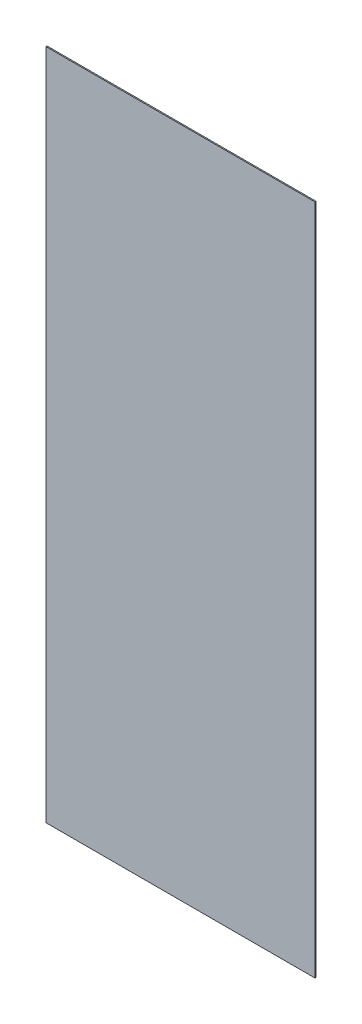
ISO-10303-21;
HEADER;
FILE_DESCRIPTION(('STEP AP214'),'2;1');
FILE_NAME('part.step','',(''),(''),'','','');
FILE_SCHEMA(('AUTOMOTIVE_DESIGN { 1 0 10303 214 1 1 1 1 }'));
ENDSEC;
DATA;
#1=APPLICATION_CONTEXT('core data for automotive mechanical design processes');
#2=APPLICATION_PROTOCOL_DEFINITION('international standard','automotive_design',2000,#1);
#3=PRODUCT_CONTEXT('',#1,'mechanical');
#4=PRODUCT('Part','Part','',(#3));
#5=PRODUCT_RELATED_PRODUCT_CATEGORY('part','',(#4));
#6=PRODUCT_DEFINITION_FORMATION('','',#4);
#7=PRODUCT_DEFINITION_CONTEXT('part definition',#1,'design');
#8=PRODUCT_DEFINITION('design','',#6,#7);
#9=PRODUCT_DEFINITION_SHAPE('','',#8);
#10=(LENGTH_UNIT() NAMED_UNIT(*) SI_UNIT(.MILLI.,.METRE.));
#11=(NAMED_UNIT(*) PLANE_ANGLE_UNIT() SI_UNIT($,.RADIAN.));
#12=(NAMED_UNIT(*) SI_UNIT($,.STERADIAN.) SOLID_ANGLE_UNIT());
#13=UNCERTAINTY_MEASURE_WITH_UNIT(LENGTH_MEASURE(1.E-05),#10,'distance_accuracy_value','');
#14=(GEOMETRIC_REPRESENTATION_CONTEXT(3) GLOBAL_UNCERTAINTY_ASSIGNED_CONTEXT((#13)) GLOBAL_UNIT_ASSIGNED_CONTEXT((#10,
#11,#12)) REPRESENTATION_CONTEXT('',''));
#15=CARTESIAN_POINT('',(0.,0.,0.));
#16=DIRECTION('',(0.,0.,1.));
#17=DIRECTION('',(1.,0.,0.));
#18=AXIS2_PLACEMENT_3D('',#15,#16,#17);
#19=CARTESIAN_POINT('',(-609.6,1524.,2.54));
#20=DIRECTION('',(1.,0.,0.));
#21=DIRECTION('',(0.,0.,-1.));
#22=AXIS2_PLACEMENT_3D('',#19,#20,#21);
#23=PLANE('',#22);
#24=DIRECTION('',(0.,-1.,0.));
#25=VECTOR('',#24,1.);
#26=CARTESIAN_POINT('',(-609.6,1524.,0.));
#27=LINE('',#26,#25);
#28=CARTESIAN_POINT('',(-609.6,1524.,0.));
#29=VERTEX_POINT('',#28);
#30=CARTESIAN_POINT('',(-609.6,0.,0.));
#31=VERTEX_POINT('',#30);
#32=EDGE_CURVE('E99',#29,#31,#27,.T.);
#33=ORIENTED_EDGE('',*,*,#32,.T.);
#34=DIRECTION('',(0.,0.,-1.));
#35=VECTOR('',#34,1.);
#36=CARTESIAN_POINT('',(-609.6,0.,2.54));
#37=LINE('',#36,#35);
#38=CARTESIAN_POINT('',(-609.6,0.,2.54));
#39=VERTEX_POINT('',#38);
#40=EDGE_CURVE('E11',#39,#31,#37,.T.);
#41=ORIENTED_EDGE('',*,*,#40,.F.);
#42=DIRECTION('',(0.,-1.,0.));
#43=VECTOR('',#42,1.);
#44=CARTESIAN_POINT('',(-609.6,1524.,2.54));
#45=LINE('',#44,#43);
#46=CARTESIAN_POINT('',(-609.6,1524.,2.54));
#47=VERTEX_POINT('',#46);
#48=EDGE_CURVE('E87',#47,#39,#45,.T.);
#49=ORIENTED_EDGE('',*,*,#48,.F.);
#50=DIRECTION('',(0.,0.,-1.));
#51=VECTOR('',#50,1.);
#52=CARTESIAN_POINT('',(-609.6,1524.,2.54));
#53=LINE('',#52,#51);
#54=EDGE_CURVE('E95',#47,#29,#53,.T.);
#55=ORIENTED_EDGE('',*,*,#54,.T.);
#56=EDGE_LOOP('',(#33,#41,#49,#55));
#57=FACE_BOUND('',#56,.T.);
#58=ADVANCED_FACE('F36',(#57),#23,.F.);
#59=CARTESIAN_POINT('',(-609.6,0.,2.54));
#60=DIRECTION('',(0.,1.,0.));
#61=DIRECTION('',(0.,0.,1.));
#62=AXIS2_PLACEMENT_3D('',#59,#60,#61);
#63=PLANE('',#62);
#64=DIRECTION('',(1.,0.,0.));
#65=VECTOR('',#64,1.);
#66=CARTESIAN_POINT('',(-609.6,0.,0.));
#67=LINE('',#66,#65);
#68=CARTESIAN_POINT('',(0.,0.,0.));
#69=VERTEX_POINT('',#68);
#70=EDGE_CURVE('E91',#31,#69,#67,.T.);
#71=ORIENTED_EDGE('',*,*,#70,.T.);
#72=DIRECTION('',(0.,0.,-1.));
#73=VECTOR('',#72,1.);
#74=CARTESIAN_POINT('',(0.,0.,2.54));
#75=LINE('',#74,#73);
#76=CARTESIAN_POINT('',(0.,0.,2.54));
#77=VERTEX_POINT('',#76);
#78=EDGE_CURVE('E44',#77,#69,#75,.T.);
#79=ORIENTED_EDGE('',*,*,#78,.F.);
#80=DIRECTION('',(1.,0.,0.));
#81=VECTOR('',#80,1.);
#82=CARTESIAN_POINT('',(-609.6,0.,2.54));
#83=LINE('',#82,#81);
#84=EDGE_CURVE('E82',#39,#77,#83,.T.);
#85=ORIENTED_EDGE('',*,*,#84,.F.);
#86=ORIENTED_EDGE('',*,*,#40,.T.);
#87=EDGE_LOOP('',(#71,#79,#85,#86));
#88=FACE_BOUND('',#87,.T.);
#89=ADVANCED_FACE('F90',(#88),#63,.F.);
#90=CARTESIAN_POINT('',(0.,1524.,2.54));
#91=DIRECTION('',(-1.,0.,0.));
#92=DIRECTION('',(0.,0.,1.));
#93=AXIS2_PLACEMENT_3D('',#90,#91,#92);
#94=PLANE('',#93);
#95=DIRECTION('',(0.,1.,0.));
#96=VECTOR('',#95,1.);
#97=CARTESIAN_POINT('',(0.,1524.,0.));
#98=LINE('',#97,#96);
#99=CARTESIAN_POINT('',(0.,1524.,0.));
#100=VERTEX_POINT('',#99);
#101=EDGE_CURVE('E69',#69,#100,#98,.T.);
#102=ORIENTED_EDGE('',*,*,#101,.T.);
#103=DIRECTION('',(0.,0.,-1.));
#104=VECTOR('',#103,1.);
#105=CARTESIAN_POINT('',(0.,1524.,2.54));
#106=LINE('',#105,#104);
#107=CARTESIAN_POINT('',(0.,1524.,2.54));
#108=VERTEX_POINT('',#107);
#109=EDGE_CURVE('E92',#108,#100,#106,.T.);
#110=ORIENTED_EDGE('',*,*,#109,.F.);
#111=DIRECTION('',(0.,1.,0.));
#112=VECTOR('',#111,1.);
#113=CARTESIAN_POINT('',(0.,1524.,2.54));
#114=LINE('',#113,#112);
#115=EDGE_CURVE('E85',#77,#108,#114,.T.);
#116=ORIENTED_EDGE('',*,*,#115,.F.);
#117=ORIENTED_EDGE('',*,*,#78,.T.);
#118=EDGE_LOOP('',(#102,#110,#116,#117));
#119=FACE_BOUND('',#118,.T.);
#120=ADVANCED_FACE('F93',(#119),#94,.F.);
#121=CARTESIAN_POINT('',(-609.6,1524.,2.54));
#122=DIRECTION('',(0.,-1.,0.));
#123=DIRECTION('',(0.,0.,-1.));
#124=AXIS2_PLACEMENT_3D('',#121,#122,#123);
#125=PLANE('',#124);
#126=DIRECTION('',(-1.,0.,0.));
#127=VECTOR('',#126,1.);
#128=CARTESIAN_POINT('',(-609.6,1524.,0.));
#129=LINE('',#128,#127);
#130=EDGE_CURVE('E75',#100,#29,#129,.T.);
#131=ORIENTED_EDGE('',*,*,#130,.T.);
#132=ORIENTED_EDGE('',*,*,#54,.F.);
#133=DIRECTION('',(-1.,0.,0.));
#134=VECTOR('',#133,1.);
#135=CARTESIAN_POINT('',(-609.6,1524.,2.54));
#136=LINE('',#135,#134);
#137=EDGE_CURVE('E52',#108,#47,#136,.T.);
#138=ORIENTED_EDGE('',*,*,#137,.F.);
#139=ORIENTED_EDGE('',*,*,#109,.T.);
#140=EDGE_LOOP('',(#131,#132,#138,#139));
#141=FACE_BOUND('',#140,.T.);
#142=ADVANCED_FACE('F106',(#141),#125,.F.);
#143=CARTESIAN_POINT('',(-609.6,0.,2.54));
#144=DIRECTION('',(0.,0.,1.));
#145=DIRECTION('',(1.,0.,0.));
#146=AXIS2_PLACEMENT_3D('',#143,#144,#145);
#147=PLANE('',#146);
#148=ORIENTED_EDGE('',*,*,#48,.T.);
#149=ORIENTED_EDGE('',*,*,#84,.T.);
#150=ORIENTED_EDGE('',*,*,#115,.T.);
#151=ORIENTED_EDGE('',*,*,#137,.T.);
#152=EDGE_LOOP('',(#148,#149,#150,#151));
#153=FACE_BOUND('',#152,.T.);
#154=ADVANCED_FACE('F83',(#153),#147,.T.);
#155=CARTESIAN_POINT('',(-609.6,0.,0.));
#156=DIRECTION('',(0.,0.,1.));
#157=DIRECTION('',(1.,0.,0.));
#158=AXIS2_PLACEMENT_3D('',#155,#156,#157);
#159=PLANE('',#158);
#160=ORIENTED_EDGE('',*,*,#32,.F.);
#161=ORIENTED_EDGE('',*,*,#130,.F.);
#162=ORIENTED_EDGE('',*,*,#101,.F.);
#163=ORIENTED_EDGE('',*,*,#70,.F.);
#164=EDGE_LOOP('',(#160,#161,#162,#163));
#165=FACE_BOUND('',#164,.T.);
#166=ADVANCED_FACE('F109',(#165),#159,.F.);
#167=CLOSED_SHELL('',(#58,#89,#120,#142,#154,#166));
#168=MANIFOLD_SOLID_BREP('B2',#167);
#169=ADVANCED_BREP_SHAPE_REPRESENTATION('',(#18,#168),#14);
#170=SHAPE_DEFINITION_REPRESENTATION(#9,#169);
ENDSEC;
END-ISO-10303-21;
